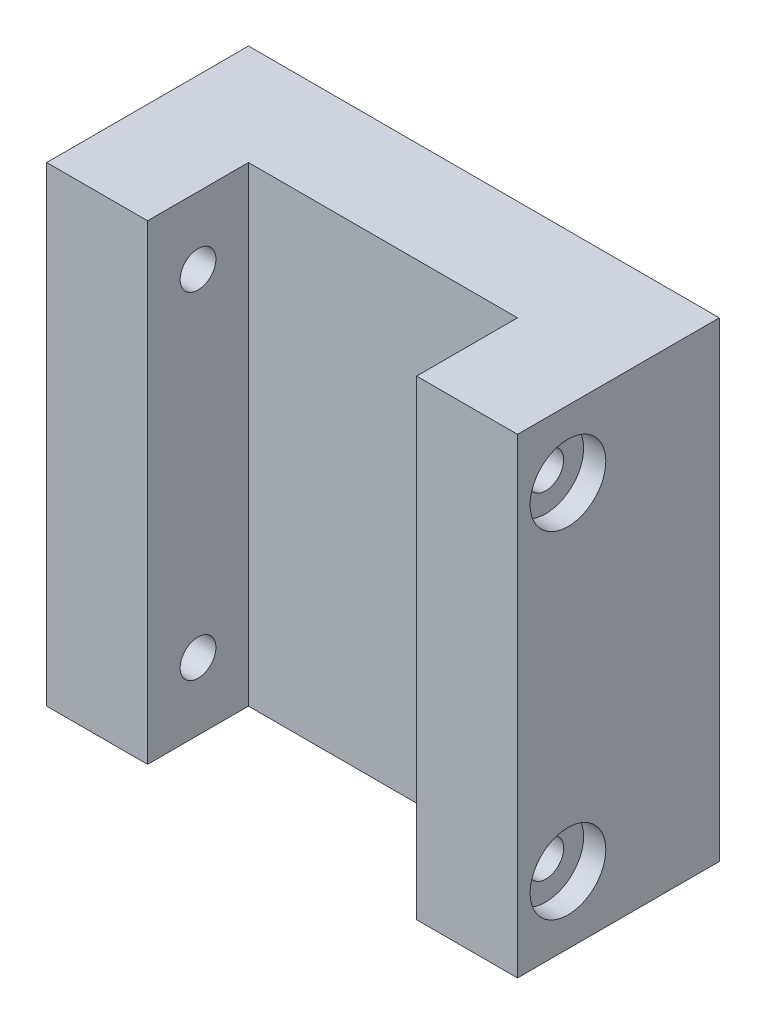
ISO-10303-21;
HEADER;
FILE_DESCRIPTION(('STEP AP214'),'2;1');
FILE_NAME('part.step','',(''),(''),'','','');
FILE_SCHEMA(('AUTOMOTIVE_DESIGN { 1 0 10303 214 1 1 1 1 }'));
ENDSEC;
DATA;
#1=APPLICATION_CONTEXT('core data for automotive mechanical design processes');
#2=APPLICATION_PROTOCOL_DEFINITION('international standard','automotive_design',2000,#1);
#3=PRODUCT_CONTEXT('',#1,'mechanical');
#4=PRODUCT('Part','Part','',(#3));
#5=PRODUCT_RELATED_PRODUCT_CATEGORY('part','',(#4));
#6=PRODUCT_DEFINITION_FORMATION('','',#4);
#7=PRODUCT_DEFINITION_CONTEXT('part definition',#1,'design');
#8=PRODUCT_DEFINITION('design','',#6,#7);
#9=PRODUCT_DEFINITION_SHAPE('','',#8);
#10=(LENGTH_UNIT() NAMED_UNIT(*) SI_UNIT(.MILLI.,.METRE.));
#11=(NAMED_UNIT(*) PLANE_ANGLE_UNIT() SI_UNIT($,.RADIAN.));
#12=(NAMED_UNIT(*) SI_UNIT($,.STERADIAN.) SOLID_ANGLE_UNIT());
#13=UNCERTAINTY_MEASURE_WITH_UNIT(LENGTH_MEASURE(1.E-05),#10,'distance_accuracy_value','');
#14=(GEOMETRIC_REPRESENTATION_CONTEXT(3) GLOBAL_UNCERTAINTY_ASSIGNED_CONTEXT((#13)) GLOBAL_UNIT_ASSIGNED_CONTEXT((#10,
#11,#12)) REPRESENTATION_CONTEXT('',''));
#15=CARTESIAN_POINT('',(0.,0.,0.));
#16=DIRECTION('',(0.,0.,1.));
#17=DIRECTION('',(1.,0.,0.));
#18=AXIS2_PLACEMENT_3D('',#15,#16,#17);
#19=CARTESIAN_POINT('',(-44.45,44.45,38.1));
#20=DIRECTION('',(0.,0.,-1.));
#21=DIRECTION('',(-1.,0.,0.));
#22=AXIS2_PLACEMENT_3D('',#19,#20,#21);
#23=PLANE('',#22);
#24=DIRECTION('',(1.,0.,0.));
#25=VECTOR('',#24,1.);
#26=CARTESIAN_POINT('',(-44.45,-44.45,38.1));
#27=LINE('',#26,#25);
#28=CARTESIAN_POINT('',(-44.45,-44.45,38.1));
#29=VERTEX_POINT('',#28);
#30=CARTESIAN_POINT('',(-25.4,-44.45,38.1));
#31=VERTEX_POINT('',#30);
#32=EDGE_CURVE('E85',#29,#31,#27,.T.);
#33=ORIENTED_EDGE('',*,*,#32,.T.);
#34=DIRECTION('',(0.,-1.,0.));
#35=VECTOR('',#34,1.);
#36=CARTESIAN_POINT('',(-25.4,44.45,38.1));
#37=LINE('',#36,#35);
#38=CARTESIAN_POINT('',(-25.4,44.45,38.1));
#39=VERTEX_POINT('',#38);
#40=EDGE_CURVE('E111',#39,#31,#37,.T.);
#41=ORIENTED_EDGE('',*,*,#40,.F.);
#42=DIRECTION('',(-1.,0.,0.));
#43=VECTOR('',#42,1.);
#44=CARTESIAN_POINT('',(-44.45,44.45,38.1));
#45=LINE('',#44,#43);
#46=CARTESIAN_POINT('',(-44.45,44.45,38.1));
#47=VERTEX_POINT('',#46);
#48=EDGE_CURVE('E56',#39,#47,#45,.T.);
#49=ORIENTED_EDGE('',*,*,#48,.T.);
#50=DIRECTION('',(0.,-1.,0.));
#51=VECTOR('',#50,1.);
#52=CARTESIAN_POINT('',(-44.45,-44.45,38.1));
#53=LINE('',#52,#51);
#54=EDGE_CURVE('E148',#47,#29,#53,.T.);
#55=ORIENTED_EDGE('',*,*,#54,.T.);
#56=EDGE_LOOP('',(#33,#41,#49,#55));
#57=FACE_BOUND('',#56,.T.);
#58=ADVANCED_FACE('F32',(#57),#23,.F.);
#59=CARTESIAN_POINT('',(-44.45,44.45,0.));
#60=DIRECTION('',(0.,0.,-1.));
#61=DIRECTION('',(-1.,0.,0.));
#62=AXIS2_PLACEMENT_3D('',#59,#60,#61);
#63=PLANE('',#62);
#64=DIRECTION('',(0.,-1.,0.));
#65=VECTOR('',#64,1.);
#66=CARTESIAN_POINT('',(-44.45,-44.45,0.));
#67=LINE('',#66,#65);
#68=CARTESIAN_POINT('',(-44.45,44.45,0.));
#69=VERTEX_POINT('',#68);
#70=CARTESIAN_POINT('',(-44.45,-44.45,0.));
#71=VERTEX_POINT('',#70);
#72=EDGE_CURVE('E145',#69,#71,#67,.T.);
#73=ORIENTED_EDGE('',*,*,#72,.F.);
#74=DIRECTION('',(-1.,0.,0.));
#75=VECTOR('',#74,1.);
#76=CARTESIAN_POINT('',(-44.45,44.45,0.));
#77=LINE('',#76,#75);
#78=CARTESIAN_POINT('',(44.45,44.45,0.));
#79=VERTEX_POINT('',#78);
#80=EDGE_CURVE('E78',#79,#69,#77,.T.);
#81=ORIENTED_EDGE('',*,*,#80,.F.);
#82=DIRECTION('',(0.,1.,0.));
#83=VECTOR('',#82,1.);
#84=CARTESIAN_POINT('',(44.45,-44.45,0.));
#85=LINE('',#84,#83);
#86=CARTESIAN_POINT('',(44.45,-44.45,0.));
#87=VERTEX_POINT('',#86);
#88=EDGE_CURVE('E162',#87,#79,#85,.T.);
#89=ORIENTED_EDGE('',*,*,#88,.F.);
#90=DIRECTION('',(1.,0.,0.));
#91=VECTOR('',#90,1.);
#92=CARTESIAN_POINT('',(-44.45,-44.45,0.));
#93=LINE('',#92,#91);
#94=EDGE_CURVE('E160',#71,#87,#93,.T.);
#95=ORIENTED_EDGE('',*,*,#94,.F.);
#96=EDGE_LOOP('',(#73,#81,#89,#95));
#97=FACE_BOUND('',#96,.T.);
#98=CARTESIAN_POINT('',(0.,0.,0.));
#99=DIRECTION('',(0.,0.,-1.));
#100=DIRECTION('',(-1.,0.,0.));
#101=AXIS2_PLACEMENT_3D('',#98,#99,#100);
#102=CIRCLE('',#101,25.3619);
#103=CARTESIAN_POINT('',(-25.3619,0.,0.));
#104=VERTEX_POINT('',#103);
#105=EDGE_CURVE('E137',#104,#104,#102,.T.);
#106=ORIENTED_EDGE('',*,*,#105,.F.);
#107=EDGE_LOOP('',(#106));
#108=FACE_BOUND('',#107,.T.);
#109=ADVANCED_FACE('F176',(#97,#108),#63,.T.);
#110=CARTESIAN_POINT('',(-44.45,-44.45,38.1));
#111=DIRECTION('',(1.,0.,0.));
#112=DIRECTION('',(0.,0.,-1.));
#113=AXIS2_PLACEMENT_3D('',#110,#111,#112);
#114=PLANE('',#113);
#115=CARTESIAN_POINT('',(-44.45,31.75,28.575));
#116=DIRECTION('',(-1.,0.,0.));
#117=DIRECTION('',(0.,0.,1.));
#118=AXIS2_PLACEMENT_3D('',#115,#116,#117);
#119=CIRCLE('',#118,7.14374999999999);
#120=CARTESIAN_POINT('',(-44.45,31.75,35.71875));
#121=VERTEX_POINT('',#120);
#122=EDGE_CURVE('E402',#121,#121,#119,.T.);
#123=ORIENTED_EDGE('',*,*,#122,.F.);
#124=EDGE_LOOP('',(#123));
#125=FACE_BOUND('',#124,.T.);
#126=CARTESIAN_POINT('',(-44.45,-31.75,28.575));
#127=DIRECTION('',(-1.,0.,0.));
#128=DIRECTION('',(0.,0.,1.));
#129=AXIS2_PLACEMENT_3D('',#126,#127,#128);
#130=CIRCLE('',#129,7.14374999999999);
#131=CARTESIAN_POINT('',(-44.45,-31.75,35.71875));
#132=VERTEX_POINT('',#131);
#133=EDGE_CURVE('E414',#132,#132,#130,.T.);
#134=ORIENTED_EDGE('',*,*,#133,.F.);
#135=EDGE_LOOP('',(#134));
#136=FACE_BOUND('',#135,.T.);
#137=ORIENTED_EDGE('',*,*,#72,.T.);
#138=DIRECTION('',(0.,0.,-1.));
#139=VECTOR('',#138,1.);
#140=CARTESIAN_POINT('',(-44.45,-44.45,38.1));
#141=LINE('',#140,#139);
#142=EDGE_CURVE('E11',#29,#71,#141,.T.);
#143=ORIENTED_EDGE('',*,*,#142,.F.);
#144=ORIENTED_EDGE('',*,*,#54,.F.);
#145=DIRECTION('',(0.,0.,-1.));
#146=VECTOR('',#145,1.);
#147=CARTESIAN_POINT('',(-44.45,44.45,38.1));
#148=LINE('',#147,#146);
#149=EDGE_CURVE('E157',#47,#69,#148,.T.);
#150=ORIENTED_EDGE('',*,*,#149,.T.);
#151=EDGE_LOOP('',(#137,#143,#144,#150));
#152=FACE_BOUND('',#151,.T.);
#153=ADVANCED_FACE('F34',(#125,#136,#152),#114,.F.);
#154=CARTESIAN_POINT('',(-44.45,-44.45,38.1));
#155=DIRECTION('',(0.,1.,0.));
#156=DIRECTION('',(0.,0.,1.));
#157=AXIS2_PLACEMENT_3D('',#154,#155,#156);
#158=PLANE('',#157);
#159=DIRECTION('',(1.,0.,0.));
#160=VECTOR('',#159,1.);
#161=CARTESIAN_POINT('',(-25.4,-44.45,19.05));
#162=LINE('',#161,#160);
#163=CARTESIAN_POINT('',(-25.4,-44.45,19.05));
#164=VERTEX_POINT('',#163);
#165=CARTESIAN_POINT('',(25.4,-44.45,19.05));
#166=VERTEX_POINT('',#165);
#167=EDGE_CURVE('E119',#164,#166,#162,.T.);
#168=ORIENTED_EDGE('',*,*,#167,.F.);
#169=DIRECTION('',(0.,0.,1.));
#170=VECTOR('',#169,1.);
#171=CARTESIAN_POINT('',(-25.4,-44.45,19.05));
#172=LINE('',#171,#170);
#173=EDGE_CURVE('E106',#164,#31,#172,.T.);
#174=ORIENTED_EDGE('',*,*,#173,.T.);
#175=ORIENTED_EDGE('',*,*,#32,.F.);
#176=ORIENTED_EDGE('',*,*,#142,.T.);
#177=ORIENTED_EDGE('',*,*,#94,.T.);
#178=DIRECTION('',(0.,0.,-1.));
#179=VECTOR('',#178,1.);
#180=CARTESIAN_POINT('',(44.45,-44.45,38.1));
#181=LINE('',#180,#179);
#182=CARTESIAN_POINT('',(44.45,-44.45,38.1));
#183=VERTEX_POINT('',#182);
#184=EDGE_CURVE('E40',#183,#87,#181,.T.);
#185=ORIENTED_EDGE('',*,*,#184,.F.);
#186=CARTESIAN_POINT('',(25.4,-44.45,38.1));
#187=VERTEX_POINT('',#186);
#188=EDGE_CURVE('E150',#187,#183,#27,.T.);
#189=ORIENTED_EDGE('',*,*,#188,.F.);
#190=DIRECTION('',(0.,0.,1.));
#191=VECTOR('',#190,1.);
#192=CARTESIAN_POINT('',(25.4,-44.45,19.05));
#193=LINE('',#192,#191);
#194=EDGE_CURVE('E47',#166,#187,#193,.T.);
#195=ORIENTED_EDGE('',*,*,#194,.F.);
#196=EDGE_LOOP('',(#168,#174,#175,#176,#177,#185,#189,#195));
#197=FACE_BOUND('',#196,.T.);
#198=ADVANCED_FACE('F124',(#197),#158,.F.);
#199=CARTESIAN_POINT('',(44.45,-44.45,38.1));
#200=DIRECTION('',(-1.,0.,0.));
#201=DIRECTION('',(0.,0.,1.));
#202=AXIS2_PLACEMENT_3D('',#199,#200,#201);
#203=PLANE('',#202);
#204=CARTESIAN_POINT('',(44.45,31.75,28.575));
#205=DIRECTION('',(1.,0.,0.));
#206=DIRECTION('',(0.,0.,-1.));
#207=AXIS2_PLACEMENT_3D('',#204,#205,#206);
#208=CIRCLE('',#207,7.14374999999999);
#209=CARTESIAN_POINT('',(44.45,31.75,21.43125));
#210=VERTEX_POINT('',#209);
#211=EDGE_CURVE('E384',#210,#210,#208,.T.);
#212=ORIENTED_EDGE('',*,*,#211,.F.);
#213=EDGE_LOOP('',(#212));
#214=FACE_BOUND('',#213,.T.);
#215=CARTESIAN_POINT('',(44.45,-31.75,28.575));
#216=DIRECTION('',(1.,0.,0.));
#217=DIRECTION('',(0.,0.,-1.));
#218=AXIS2_PLACEMENT_3D('',#215,#216,#217);
#219=CIRCLE('',#218,7.14374999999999);
#220=CARTESIAN_POINT('',(44.45,-31.75,21.43125));
#221=VERTEX_POINT('',#220);
#222=EDGE_CURVE('E396',#221,#221,#219,.T.);
#223=ORIENTED_EDGE('',*,*,#222,.F.);
#224=EDGE_LOOP('',(#223));
#225=FACE_BOUND('',#224,.T.);
#226=ORIENTED_EDGE('',*,*,#88,.T.);
#227=DIRECTION('',(0.,0.,-1.));
#228=VECTOR('',#227,1.);
#229=CARTESIAN_POINT('',(44.45,44.45,38.1));
#230=LINE('',#229,#228);
#231=CARTESIAN_POINT('',(44.45,44.45,38.1));
#232=VERTEX_POINT('',#231);
#233=EDGE_CURVE('E166',#232,#79,#230,.T.);
#234=ORIENTED_EDGE('',*,*,#233,.F.);
#235=DIRECTION('',(0.,1.,0.));
#236=VECTOR('',#235,1.);
#237=CARTESIAN_POINT('',(44.45,-44.45,38.1));
#238=LINE('',#237,#236);
#239=EDGE_CURVE('E152',#183,#232,#238,.T.);
#240=ORIENTED_EDGE('',*,*,#239,.F.);
#241=ORIENTED_EDGE('',*,*,#184,.T.);
#242=EDGE_LOOP('',(#226,#234,#240,#241));
#243=FACE_BOUND('',#242,.T.);
#244=ADVANCED_FACE('F172',(#214,#225,#243),#203,.F.);
#245=CARTESIAN_POINT('',(-44.45,44.45,38.1));
#246=DIRECTION('',(0.,-1.,0.));
#247=DIRECTION('',(0.,0.,-1.));
#248=AXIS2_PLACEMENT_3D('',#245,#246,#247);
#249=PLANE('',#248);
#250=ORIENTED_EDGE('',*,*,#48,.F.);
#251=DIRECTION('',(0.,0.,1.));
#252=VECTOR('',#251,1.);
#253=CARTESIAN_POINT('',(-25.4,44.45,19.05));
#254=LINE('',#253,#252);
#255=CARTESIAN_POINT('',(-25.4,44.45,19.05));
#256=VERTEX_POINT('',#255);
#257=EDGE_CURVE('E135',#256,#39,#254,.T.);
#258=ORIENTED_EDGE('',*,*,#257,.F.);
#259=DIRECTION('',(-1.,0.,0.));
#260=VECTOR('',#259,1.);
#261=CARTESIAN_POINT('',(-25.4,44.45,19.05));
#262=LINE('',#261,#260);
#263=CARTESIAN_POINT('',(25.4,44.45,19.05));
#264=VERTEX_POINT('',#263);
#265=EDGE_CURVE('E113',#264,#256,#262,.T.);
#266=ORIENTED_EDGE('',*,*,#265,.F.);
#267=DIRECTION('',(0.,0.,1.));
#268=VECTOR('',#267,1.);
#269=CARTESIAN_POINT('',(25.4,44.45,19.05));
#270=LINE('',#269,#268);
#271=CARTESIAN_POINT('',(25.4,44.45,38.1));
#272=VERTEX_POINT('',#271);
#273=EDGE_CURVE('E138',#264,#272,#270,.T.);
#274=ORIENTED_EDGE('',*,*,#273,.T.);
#275=EDGE_CURVE('E154',#232,#272,#45,.T.);
#276=ORIENTED_EDGE('',*,*,#275,.F.);
#277=ORIENTED_EDGE('',*,*,#233,.T.);
#278=ORIENTED_EDGE('',*,*,#80,.T.);
#279=ORIENTED_EDGE('',*,*,#149,.F.);
#280=EDGE_LOOP('',(#250,#258,#266,#274,#276,#277,#278,#279));
#281=FACE_BOUND('',#280,.T.);
#282=ADVANCED_FACE('F181',(#281),#249,.F.);
#283=ORIENTED_EDGE('',*,*,#275,.T.);
#284=DIRECTION('',(0.,1.,0.));
#285=VECTOR('',#284,1.);
#286=CARTESIAN_POINT('',(25.4,44.45,38.1));
#287=LINE('',#286,#285);
#288=EDGE_CURVE('E122',#187,#272,#287,.T.);
#289=ORIENTED_EDGE('',*,*,#288,.F.);
#290=ORIENTED_EDGE('',*,*,#188,.T.);
#291=ORIENTED_EDGE('',*,*,#239,.T.);
#292=EDGE_LOOP('',(#283,#289,#290,#291));
#293=FACE_BOUND('',#292,.T.);
#294=ADVANCED_FACE('F184',(#293),#23,.F.);
#295=CARTESIAN_POINT('',(0.,0.,-13.4874));
#296=DIRECTION('',(0.,0.,1.));
#297=DIRECTION('',(1.,0.,0.));
#298=AXIS2_PLACEMENT_3D('',#295,#296,#297);
#299=CYLINDRICAL_SURFACE('',#298,25.3619);
#300=CARTESIAN_POINT('',(0.,0.,-13.4874));
#301=DIRECTION('',(0.,0.,-1.));
#302=DIRECTION('',(-1.,0.,0.));
#303=AXIS2_PLACEMENT_3D('',#300,#301,#302);
#304=CIRCLE('',#303,25.3619);
#305=CARTESIAN_POINT('',(-25.3619,0.,-13.4874));
#306=VERTEX_POINT('',#305);
#307=EDGE_CURVE('E142',#306,#306,#304,.T.);
#308=ORIENTED_EDGE('',*,*,#307,.F.);
#309=EDGE_LOOP('',(#308));
#310=FACE_BOUND('',#309,.T.);
#311=ORIENTED_EDGE('',*,*,#105,.T.);
#312=EDGE_LOOP('',(#311));
#313=FACE_BOUND('',#312,.T.);
#314=ADVANCED_FACE('F191',(#310,#313),#299,.T.);
#315=CARTESIAN_POINT('',(0.,0.,-13.4874));
#316=DIRECTION('',(0.,0.,-1.));
#317=DIRECTION('',(-1.,0.,0.));
#318=AXIS2_PLACEMENT_3D('',#315,#316,#317);
#319=PLANE('',#318);
#320=ORIENTED_EDGE('',*,*,#307,.T.);
#321=EDGE_LOOP('',(#320));
#322=FACE_BOUND('',#321,.T.);
#323=ADVANCED_FACE('F197',(#322),#319,.T.);
#324=CARTESIAN_POINT('',(-25.4,44.45,19.05));
#325=DIRECTION('',(-1.,0.,0.));
#326=DIRECTION('',(0.,-1.,0.));
#327=AXIS2_PLACEMENT_3D('',#324,#325,#326);
#328=PLANE('',#327);
#329=CARTESIAN_POINT('',(-25.4,31.75,28.575));
#330=DIRECTION('',(-1.,0.,0.));
#331=DIRECTION('',(0.,-1.,0.));
#332=AXIS2_PLACEMENT_3D('',#329,#330,#331);
#333=CIRCLE('',#332,3.3782);
#334=CARTESIAN_POINT('',(-25.4,28.3718,28.575));
#335=VERTEX_POINT('',#334);
#336=EDGE_CURVE('E411',#335,#335,#333,.T.);
#337=ORIENTED_EDGE('',*,*,#336,.T.);
#338=EDGE_LOOP('',(#337));
#339=FACE_BOUND('',#338,.T.);
#340=CARTESIAN_POINT('',(-25.4,-31.75,28.575));
#341=DIRECTION('',(-1.,0.,0.));
#342=DIRECTION('',(0.,-1.,0.));
#343=AXIS2_PLACEMENT_3D('',#340,#341,#342);
#344=CIRCLE('',#343,3.3782);
#345=CARTESIAN_POINT('',(-25.4,-35.1282,28.575));
#346=VERTEX_POINT('',#345);
#347=EDGE_CURVE('E133',#346,#346,#344,.T.);
#348=ORIENTED_EDGE('',*,*,#347,.T.);
#349=EDGE_LOOP('',(#348));
#350=FACE_BOUND('',#349,.T.);
#351=ORIENTED_EDGE('',*,*,#40,.T.);
#352=ORIENTED_EDGE('',*,*,#173,.F.);
#353=DIRECTION('',(0.,-1.,0.));
#354=VECTOR('',#353,1.);
#355=CARTESIAN_POINT('',(-25.4,44.45,19.05));
#356=LINE('',#355,#354);
#357=EDGE_CURVE('E109',#256,#164,#356,.T.);
#358=ORIENTED_EDGE('',*,*,#357,.F.);
#359=ORIENTED_EDGE('',*,*,#257,.T.);
#360=EDGE_LOOP('',(#351,#352,#358,#359));
#361=FACE_BOUND('',#360,.T.);
#362=ADVANCED_FACE('F108',(#339,#350,#361),#328,.F.);
#363=CARTESIAN_POINT('',(25.4,44.45,19.05));
#364=DIRECTION('',(1.,0.,0.));
#365=DIRECTION('',(0.,1.,0.));
#366=AXIS2_PLACEMENT_3D('',#363,#364,#365);
#367=PLANE('',#366);
#368=CARTESIAN_POINT('',(25.4,31.75,28.575));
#369=DIRECTION('',(1.,0.,0.));
#370=DIRECTION('',(0.,1.,0.));
#371=AXIS2_PLACEMENT_3D('',#368,#369,#370);
#372=CIRCLE('',#371,3.3782);
#373=CARTESIAN_POINT('',(25.4,35.1282,28.575));
#374=VERTEX_POINT('',#373);
#375=EDGE_CURVE('E377',#374,#374,#372,.T.);
#376=ORIENTED_EDGE('',*,*,#375,.T.);
#377=EDGE_LOOP('',(#376));
#378=FACE_BOUND('',#377,.T.);
#379=CARTESIAN_POINT('',(25.4,-31.75,28.575));
#380=DIRECTION('',(1.,0.,0.));
#381=DIRECTION('',(0.,1.,0.));
#382=AXIS2_PLACEMENT_3D('',#379,#380,#381);
#383=CIRCLE('',#382,3.3782);
#384=CARTESIAN_POINT('',(25.4,-28.3718,28.575));
#385=VERTEX_POINT('',#384);
#386=EDGE_CURVE('E399',#385,#385,#383,.T.);
#387=ORIENTED_EDGE('',*,*,#386,.T.);
#388=EDGE_LOOP('',(#387));
#389=FACE_BOUND('',#388,.T.);
#390=ORIENTED_EDGE('',*,*,#288,.T.);
#391=ORIENTED_EDGE('',*,*,#273,.F.);
#392=DIRECTION('',(0.,1.,0.));
#393=VECTOR('',#392,1.);
#394=CARTESIAN_POINT('',(25.4,44.45,19.05));
#395=LINE('',#394,#393);
#396=EDGE_CURVE('E126',#166,#264,#395,.T.);
#397=ORIENTED_EDGE('',*,*,#396,.F.);
#398=ORIENTED_EDGE('',*,*,#194,.T.);
#399=EDGE_LOOP('',(#390,#391,#397,#398));
#400=FACE_BOUND('',#399,.T.);
#401=ADVANCED_FACE('F201',(#378,#389,#400),#367,.F.);
#402=CARTESIAN_POINT('',(-25.4,-44.45,19.05));
#403=DIRECTION('',(0.,0.,1.));
#404=DIRECTION('',(1.,0.,0.));
#405=AXIS2_PLACEMENT_3D('',#402,#403,#404);
#406=PLANE('',#405);
#407=ORIENTED_EDGE('',*,*,#357,.T.);
#408=ORIENTED_EDGE('',*,*,#167,.T.);
#409=ORIENTED_EDGE('',*,*,#396,.T.);
#410=ORIENTED_EDGE('',*,*,#265,.T.);
#411=EDGE_LOOP('',(#407,#408,#409,#410));
#412=FACE_BOUND('',#411,.T.);
#413=ADVANCED_FACE('F117',(#412),#406,.T.);
#414=CARTESIAN_POINT('',(-44.45,-31.75,28.575));
#415=DIRECTION('',(-1.,0.,0.));
#416=DIRECTION('',(0.,0.,1.));
#417=AXIS2_PLACEMENT_3D('',#414,#415,#416);
#418=CYLINDRICAL_SURFACE('',#417,3.3782);
#419=ORIENTED_EDGE('',*,*,#347,.F.);
#420=EDGE_LOOP('',(#419));
#421=FACE_BOUND('',#420,.T.);
#422=CARTESIAN_POINT('',(-40.259,-31.75,28.575));
#423=DIRECTION('',(-1.,0.,0.));
#424=DIRECTION('',(0.,0.,1.));
#425=AXIS2_PLACEMENT_3D('',#422,#423,#424);
#426=CIRCLE('',#425,3.3782);
#427=CARTESIAN_POINT('',(-40.259,-31.75,31.9532));
#428=VERTEX_POINT('',#427);
#429=EDGE_CURVE('E420',#428,#428,#426,.T.);
#430=ORIENTED_EDGE('',*,*,#429,.T.);
#431=EDGE_LOOP('',(#430));
#432=FACE_BOUND('',#431,.T.);
#433=ADVANCED_FACE('F209',(#421,#432),#418,.F.);
#434=CARTESIAN_POINT('',(-40.259,-28.3718,28.575));
#435=DIRECTION('',(1.,0.,0.));
#436=DIRECTION('',(0.,0.,-1.));
#437=AXIS2_PLACEMENT_3D('',#434,#435,#436);
#438=PLANE('',#437);
#439=ORIENTED_EDGE('',*,*,#429,.F.);
#440=EDGE_LOOP('',(#439));
#441=FACE_BOUND('',#440,.T.);
#442=CARTESIAN_POINT('',(-40.259,-31.75,28.575));
#443=DIRECTION('',(-1.,0.,0.));
#444=DIRECTION('',(0.,0.,1.));
#445=AXIS2_PLACEMENT_3D('',#442,#443,#444);
#446=CIRCLE('',#445,7.14375);
#447=CARTESIAN_POINT('',(-40.259,-31.75,35.71875));
#448=VERTEX_POINT('',#447);
#449=EDGE_CURVE('E417',#448,#448,#446,.T.);
#450=ORIENTED_EDGE('',*,*,#449,.T.);
#451=EDGE_LOOP('',(#450));
#452=FACE_BOUND('',#451,.T.);
#453=ADVANCED_FACE('F246',(#441,#452),#438,.F.);
#454=CARTESIAN_POINT('',(-44.45,-31.75,28.575));
#455=DIRECTION('',(-1.,0.,0.));
#456=DIRECTION('',(0.,0.,1.));
#457=AXIS2_PLACEMENT_3D('',#454,#455,#456);
#458=CYLINDRICAL_SURFACE('',#457,7.14375);
#459=ORIENTED_EDGE('',*,*,#449,.F.);
#460=EDGE_LOOP('',(#459));
#461=FACE_BOUND('',#460,.T.);
#462=ORIENTED_EDGE('',*,*,#133,.T.);
#463=EDGE_LOOP('',(#462));
#464=FACE_BOUND('',#463,.T.);
#465=ADVANCED_FACE('F256',(#461,#464),#458,.F.);
#466=CARTESIAN_POINT('',(-44.45,31.75,28.575));
#467=DIRECTION('',(-1.,0.,0.));
#468=DIRECTION('',(0.,0.,1.));
#469=AXIS2_PLACEMENT_3D('',#466,#467,#468);
#470=CYLINDRICAL_SURFACE('',#469,3.3782);
#471=ORIENTED_EDGE('',*,*,#336,.F.);
#472=EDGE_LOOP('',(#471));
#473=FACE_BOUND('',#472,.T.);
#474=CARTESIAN_POINT('',(-40.259,31.75,28.575));
#475=DIRECTION('',(-1.,0.,0.));
#476=DIRECTION('',(0.,0.,1.));
#477=AXIS2_PLACEMENT_3D('',#474,#475,#476);
#478=CIRCLE('',#477,3.3782);
#479=CARTESIAN_POINT('',(-40.259,31.75,31.9532));
#480=VERTEX_POINT('',#479);
#481=EDGE_CURVE('E408',#480,#480,#478,.T.);
#482=ORIENTED_EDGE('',*,*,#481,.T.);
#483=EDGE_LOOP('',(#482));
#484=FACE_BOUND('',#483,.T.);
#485=ADVANCED_FACE('F266',(#473,#484),#470,.F.);
#486=CARTESIAN_POINT('',(-40.259,35.1282,28.575));
#487=DIRECTION('',(1.,0.,0.));
#488=DIRECTION('',(0.,0.,-1.));
#489=AXIS2_PLACEMENT_3D('',#486,#487,#488);
#490=PLANE('',#489);
#491=ORIENTED_EDGE('',*,*,#481,.F.);
#492=EDGE_LOOP('',(#491));
#493=FACE_BOUND('',#492,.T.);
#494=CARTESIAN_POINT('',(-40.259,31.75,28.575));
#495=DIRECTION('',(-1.,0.,0.));
#496=DIRECTION('',(0.,0.,1.));
#497=AXIS2_PLACEMENT_3D('',#494,#495,#496);
#498=CIRCLE('',#497,7.14375);
#499=CARTESIAN_POINT('',(-40.259,31.75,35.71875));
#500=VERTEX_POINT('',#499);
#501=EDGE_CURVE('E405',#500,#500,#498,.T.);
#502=ORIENTED_EDGE('',*,*,#501,.T.);
#503=EDGE_LOOP('',(#502));
#504=FACE_BOUND('',#503,.T.);
#505=ADVANCED_FACE('F276',(#493,#504),#490,.F.);
#506=CARTESIAN_POINT('',(-44.45,31.75,28.575));
#507=DIRECTION('',(-1.,0.,0.));
#508=DIRECTION('',(0.,0.,1.));
#509=AXIS2_PLACEMENT_3D('',#506,#507,#508);
#510=CYLINDRICAL_SURFACE('',#509,7.14374999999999);
#511=ORIENTED_EDGE('',*,*,#501,.F.);
#512=EDGE_LOOP('',(#511));
#513=FACE_BOUND('',#512,.T.);
#514=ORIENTED_EDGE('',*,*,#122,.T.);
#515=EDGE_LOOP('',(#514));
#516=FACE_BOUND('',#515,.T.);
#517=ADVANCED_FACE('F286',(#513,#516),#510,.F.);
#518=CARTESIAN_POINT('',(44.45,-31.75,28.575));
#519=DIRECTION('',(1.,0.,0.));
#520=DIRECTION('',(0.,0.,-1.));
#521=AXIS2_PLACEMENT_3D('',#518,#519,#520);
#522=CYLINDRICAL_SURFACE('',#521,7.14375);
#523=CARTESIAN_POINT('',(40.259,-31.75,28.575));
#524=DIRECTION('',(1.,0.,0.));
#525=DIRECTION('',(0.,0.,-1.));
#526=AXIS2_PLACEMENT_3D('',#523,#524,#525);
#527=CIRCLE('',#526,7.14375);
#528=CARTESIAN_POINT('',(40.259,-31.75,21.43125));
#529=VERTEX_POINT('',#528);
#530=EDGE_CURVE('E393',#529,#529,#527,.T.);
#531=ORIENTED_EDGE('',*,*,#530,.F.);
#532=EDGE_LOOP('',(#531));
#533=FACE_BOUND('',#532,.T.);
#534=ORIENTED_EDGE('',*,*,#222,.T.);
#535=EDGE_LOOP('',(#534));
#536=FACE_BOUND('',#535,.T.);
#537=ADVANCED_FACE('F296',(#533,#536),#522,.F.);
#538=CARTESIAN_POINT('',(40.259,-28.3718,28.575));
#539=DIRECTION('',(-1.,0.,0.));
#540=DIRECTION('',(0.,0.,1.));
#541=AXIS2_PLACEMENT_3D('',#538,#539,#540);
#542=PLANE('',#541);
#543=CARTESIAN_POINT('',(40.259,-31.75,28.575));
#544=DIRECTION('',(1.,0.,0.));
#545=DIRECTION('',(0.,0.,-1.));
#546=AXIS2_PLACEMENT_3D('',#543,#544,#545);
#547=CIRCLE('',#546,3.3782);
#548=CARTESIAN_POINT('',(40.259,-31.75,25.1968));
#549=VERTEX_POINT('',#548);
#550=EDGE_CURVE('E390',#549,#549,#547,.T.);
#551=ORIENTED_EDGE('',*,*,#550,.F.);
#552=EDGE_LOOP('',(#551));
#553=FACE_BOUND('',#552,.T.);
#554=ORIENTED_EDGE('',*,*,#530,.T.);
#555=EDGE_LOOP('',(#554));
#556=FACE_BOUND('',#555,.T.);
#557=ADVANCED_FACE('F321',(#553,#556),#542,.F.);
#558=CARTESIAN_POINT('',(44.45,-31.75,28.575));
#559=DIRECTION('',(1.,0.,0.));
#560=DIRECTION('',(0.,0.,-1.));
#561=AXIS2_PLACEMENT_3D('',#558,#559,#560);
#562=CYLINDRICAL_SURFACE('',#561,3.3782);
#563=ORIENTED_EDGE('',*,*,#386,.F.);
#564=EDGE_LOOP('',(#563));
#565=FACE_BOUND('',#564,.T.);
#566=ORIENTED_EDGE('',*,*,#550,.T.);
#567=EDGE_LOOP('',(#566));
#568=FACE_BOUND('',#567,.T.);
#569=ADVANCED_FACE('F331',(#565,#568),#562,.F.);
#570=CARTESIAN_POINT('',(44.45,31.75,28.575));
#571=DIRECTION('',(1.,0.,0.));
#572=DIRECTION('',(0.,0.,-1.));
#573=AXIS2_PLACEMENT_3D('',#570,#571,#572);
#574=CYLINDRICAL_SURFACE('',#573,7.14374999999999);
#575=CARTESIAN_POINT('',(40.259,31.75,28.575));
#576=DIRECTION('',(1.,0.,0.));
#577=DIRECTION('',(0.,0.,-1.));
#578=AXIS2_PLACEMENT_3D('',#575,#576,#577);
#579=CIRCLE('',#578,7.14375);
#580=CARTESIAN_POINT('',(40.259,31.75,21.43125));
#581=VERTEX_POINT('',#580);
#582=EDGE_CURVE('E381',#581,#581,#579,.T.);
#583=ORIENTED_EDGE('',*,*,#582,.F.);
#584=EDGE_LOOP('',(#583));
#585=FACE_BOUND('',#584,.T.);
#586=ORIENTED_EDGE('',*,*,#211,.T.);
#587=EDGE_LOOP('',(#586));
#588=FACE_BOUND('',#587,.T.);
#589=ADVANCED_FACE('F341',(#585,#588),#574,.F.);
#590=CARTESIAN_POINT('',(40.259,35.1282,28.575));
#591=DIRECTION('',(-1.,0.,0.));
#592=DIRECTION('',(0.,0.,1.));
#593=AXIS2_PLACEMENT_3D('',#590,#591,#592);
#594=PLANE('',#593);
#595=CARTESIAN_POINT('',(40.259,31.75,28.575));
#596=DIRECTION('',(1.,0.,0.));
#597=DIRECTION('',(0.,0.,-1.));
#598=AXIS2_PLACEMENT_3D('',#595,#596,#597);
#599=CIRCLE('',#598,3.3782);
#600=CARTESIAN_POINT('',(40.259,31.75,25.1968));
#601=VERTEX_POINT('',#600);
#602=EDGE_CURVE('E380',#601,#601,#599,.T.);
#603=ORIENTED_EDGE('',*,*,#602,.F.);
#604=EDGE_LOOP('',(#603));
#605=FACE_BOUND('',#604,.T.);
#606=ORIENTED_EDGE('',*,*,#582,.T.);
#607=EDGE_LOOP('',(#606));
#608=FACE_BOUND('',#607,.T.);
#609=ADVANCED_FACE('F351',(#605,#608),#594,.F.);
#610=CARTESIAN_POINT('',(44.45,31.75,28.575));
#611=DIRECTION('',(1.,0.,0.));
#612=DIRECTION('',(0.,0.,-1.));
#613=AXIS2_PLACEMENT_3D('',#610,#611,#612);
#614=CYLINDRICAL_SURFACE('',#613,3.3782);
#615=ORIENTED_EDGE('',*,*,#375,.F.);
#616=EDGE_LOOP('',(#615));
#617=FACE_BOUND('',#616,.T.);
#618=ORIENTED_EDGE('',*,*,#602,.T.);
#619=EDGE_LOOP('',(#618));
#620=FACE_BOUND('',#619,.T.);
#621=ADVANCED_FACE('F361',(#617,#620),#614,.F.);
#622=CLOSED_SHELL('',(#58,#109,#153,#198,#244,#282,#294,#314,#323,#362,#401,#413,#433,#453,#465,
#485,#505,#517,#537,#557,#569,#589,#609,#621));
#623=MANIFOLD_SOLID_BREP('B2',#622);
#624=ADVANCED_BREP_SHAPE_REPRESENTATION('',(#18,#623),#14);
#625=SHAPE_DEFINITION_REPRESENTATION(#9,#624);
ENDSEC;
END-ISO-10303-21;
